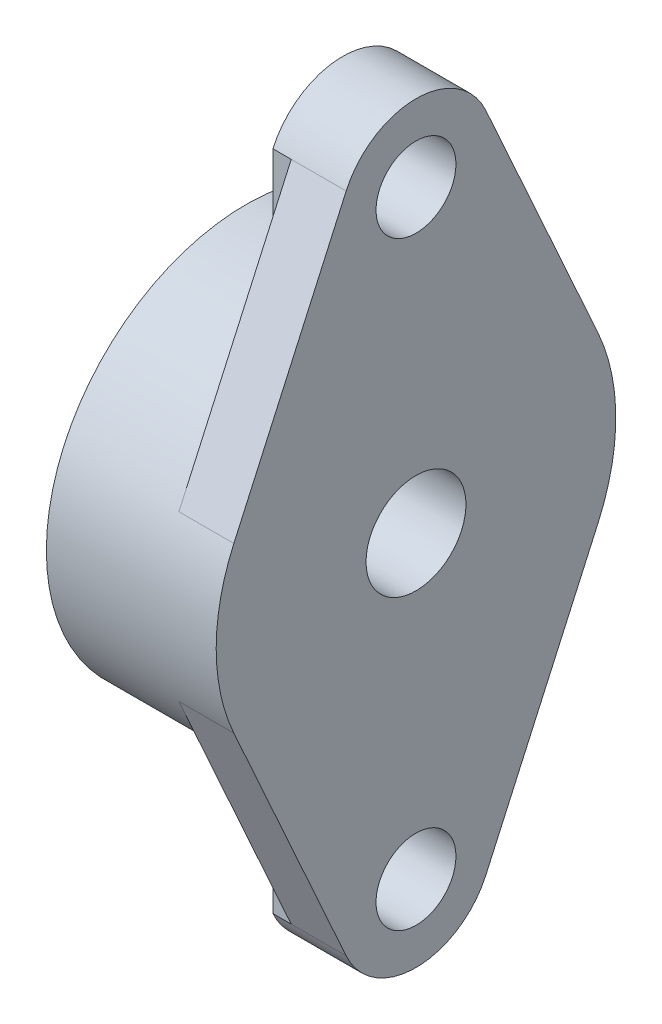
ISO-10303-21;
HEADER;
FILE_DESCRIPTION(('STEP AP214'),'2;1');
FILE_NAME('part.step','',(''),(''),'','','');
FILE_SCHEMA(('AUTOMOTIVE_DESIGN { 1 0 10303 214 1 1 1 1 }'));
ENDSEC;
DATA;
#1=APPLICATION_CONTEXT('core data for automotive mechanical design processes');
#2=APPLICATION_PROTOCOL_DEFINITION('international standard','automotive_design',2000,#1);
#3=PRODUCT_CONTEXT('',#1,'mechanical');
#4=PRODUCT('Part','Part','',(#3));
#5=PRODUCT_RELATED_PRODUCT_CATEGORY('part','',(#4));
#6=PRODUCT_DEFINITION_FORMATION('','',#4);
#7=PRODUCT_DEFINITION_CONTEXT('part definition',#1,'design');
#8=PRODUCT_DEFINITION('design','',#6,#7);
#9=PRODUCT_DEFINITION_SHAPE('','',#8);
#10=(LENGTH_UNIT() NAMED_UNIT(*) SI_UNIT(.MILLI.,.METRE.));
#11=(NAMED_UNIT(*) PLANE_ANGLE_UNIT() SI_UNIT($,.RADIAN.));
#12=(NAMED_UNIT(*) SI_UNIT($,.STERADIAN.) SOLID_ANGLE_UNIT());
#13=UNCERTAINTY_MEASURE_WITH_UNIT(LENGTH_MEASURE(1.E-05),#10,'distance_accuracy_value','');
#14=(GEOMETRIC_REPRESENTATION_CONTEXT(3) GLOBAL_UNCERTAINTY_ASSIGNED_CONTEXT((#13)) GLOBAL_UNIT_ASSIGNED_CONTEXT((#10,
#11,#12)) REPRESENTATION_CONTEXT('',''));
#15=CARTESIAN_POINT('',(0.,0.,0.));
#16=DIRECTION('',(0.,0.,1.));
#17=DIRECTION('',(1.,0.,0.));
#18=AXIS2_PLACEMENT_3D('',#15,#16,#17);
#19=CARTESIAN_POINT('',(-8.25,-49.9521254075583,-27.3475572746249));
#20=DIRECTION('',(-1.,0.,0.));
#21=DIRECTION('',(0.,0.,1.));
#22=AXIS2_PLACEMENT_3D('',#19,#20,#21);
#23=PLANE('',#22);
#24=DIRECTION('',(0.,-1.,0.));
#25=VECTOR('',#24,1.);
#26=CARTESIAN_POINT('',(-8.25,-38.9182643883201,-10.4832302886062));
#27=LINE('',#26,#25);
#28=CARTESIAN_POINT('',(-8.25,-28.1087509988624,-10.4832302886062));
#29=VERTEX_POINT('',#28);
#30=CARTESIAN_POINT('',(-8.25,-49.7277777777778,-10.4832302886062));
#31=VERTEX_POINT('',#30);
#32=EDGE_CURVE('E71',#29,#31,#27,.T.);
#33=ORIENTED_EDGE('',*,*,#32,.F.);
#34=CARTESIAN_POINT('',(-8.25,0.,0.));
#35=DIRECTION('',(-1.,0.,0.));
#36=DIRECTION('',(0.,0.,1.));
#37=AXIS2_PLACEMENT_3D('',#34,#35,#36);
#38=CIRCLE('',#37,30.);
#39=CARTESIAN_POINT('',(-8.25,-12.3365061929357,-27.3461262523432));
#40=VERTEX_POINT('',#39);
#41=EDGE_CURVE('E208',#40,#29,#38,.T.);
#42=ORIENTED_EDGE('',*,*,#41,.F.);
#43=DIRECTION('',(0.,0.911585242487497,-0.411111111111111));
#44=VECTOR('',#43,1.);
#45=CARTESIAN_POINT('',(-8.25,-31.0305555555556,-18.9153937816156));
#46=LINE('',#45,#44);
#47=EDGE_CURVE('E308',#31,#40,#46,.T.);
#48=ORIENTED_EDGE('',*,*,#47,.F.);
#49=EDGE_LOOP('',(#33,#42,#48));
#50=FACE_BOUND('',#49,.T.);
#51=ADVANCED_FACE('F16',(#50),#23,.T.);
#52=CARTESIAN_POINT('',(-11.,-49.7277777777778,-10.4832302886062));
#53=DIRECTION('',(0.,0.,-1.));
#54=DIRECTION('',(0.,1.,0.));
#55=AXIS2_PLACEMENT_3D('',#52,#53,#54);
#56=PLANE('',#55);
#57=DIRECTION('',(0.,-1.,0.));
#58=VECTOR('',#57,1.);
#59=CARTESIAN_POINT('',(-11.,-42.4463317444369,-10.4832302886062));
#60=LINE('',#59,#58);
#61=CARTESIAN_POINT('',(-11.,-28.1087509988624,-10.4832302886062));
#62=VERTEX_POINT('',#61);
#63=CARTESIAN_POINT('',(-11.,-49.7277777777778,-10.4832302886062));
#64=VERTEX_POINT('',#63);
#65=EDGE_CURVE('E65',#62,#64,#60,.T.);
#66=ORIENTED_EDGE('',*,*,#65,.F.);
#67=DIRECTION('',(-1.,0.,0.));
#68=VECTOR('',#67,1.);
#69=CARTESIAN_POINT('',(-12.75,-28.1087509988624,-10.4832302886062));
#70=LINE('',#69,#68);
#71=EDGE_CURVE('E300',#29,#62,#70,.T.);
#72=ORIENTED_EDGE('',*,*,#71,.F.);
#73=ORIENTED_EDGE('',*,*,#32,.T.);
#74=DIRECTION('',(1.,0.,0.));
#75=VECTOR('',#74,1.);
#76=CARTESIAN_POINT('',(-5.5,-49.7277777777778,-10.4832302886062));
#77=LINE('',#76,#75);
#78=EDGE_CURVE('E316',#64,#31,#77,.T.);
#79=ORIENTED_EDGE('',*,*,#78,.F.);
#80=EDGE_LOOP('',(#66,#72,#73,#79));
#81=FACE_BOUND('',#80,.T.);
#82=ADVANCED_FACE('F482',(#81),#56,.T.);
#83=CARTESIAN_POINT('',(-8.25,12.1121584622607,-27.3475572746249));
#84=DIRECTION('',(-1.,0.,0.));
#85=DIRECTION('',(0.,0.,1.));
#86=AXIS2_PLACEMENT_3D('',#83,#84,#85);
#87=PLANE('',#86);
#88=CARTESIAN_POINT('',(-8.25,0.,0.));
#89=DIRECTION('',(-1.,0.,0.));
#90=DIRECTION('',(0.,0.,1.));
#91=AXIS2_PLACEMENT_3D('',#88,#89,#90);
#92=CIRCLE('',#91,30.);
#93=CARTESIAN_POINT('',(-8.25,28.1087509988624,-10.4832302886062));
#94=VERTEX_POINT('',#93);
#95=CARTESIAN_POINT('',(-8.25,12.3365061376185,-27.3461262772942));
#96=VERTEX_POINT('',#95);
#97=EDGE_CURVE('E360',#94,#96,#92,.T.);
#98=ORIENTED_EDGE('',*,*,#97,.F.);
#99=DIRECTION('',(0.,-1.,0.));
#100=VECTOR('',#99,1.);
#101=CARTESIAN_POINT('',(-8.25,38.9182643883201,-10.4832302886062));
#102=LINE('',#101,#100);
#103=CARTESIAN_POINT('',(-8.25,49.7277777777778,-10.4832302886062));
#104=VERTEX_POINT('',#103);
#105=EDGE_CURVE('E270',#104,#94,#102,.T.);
#106=ORIENTED_EDGE('',*,*,#105,.F.);
#107=DIRECTION('',(0.,0.911585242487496,0.411111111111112));
#108=VECTOR('',#107,1.);
#109=CARTESIAN_POINT('',(-8.25,31.0305555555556,-18.9153937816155));
#110=LINE('',#109,#108);
#111=EDGE_CURVE('E203',#96,#104,#110,.T.);
#112=ORIENTED_EDGE('',*,*,#111,.F.);
#113=EDGE_LOOP('',(#98,#106,#112));
#114=FACE_BOUND('',#113,.T.);
#115=ADVANCED_FACE('F371',(#114),#87,.T.);
#116=CARTESIAN_POINT('',(-11.,28.1087509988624,-10.4832302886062));
#117=DIRECTION('',(0.,0.,-1.));
#118=DIRECTION('',(0.,1.,0.));
#119=AXIS2_PLACEMENT_3D('',#116,#117,#118);
#120=PLANE('',#119);
#121=DIRECTION('',(0.,-1.,0.));
#122=VECTOR('',#121,1.);
#123=CARTESIAN_POINT('',(-11.,42.4463317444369,-10.4832302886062));
#124=LINE('',#123,#122);
#125=CARTESIAN_POINT('',(-11.,49.7277777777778,-10.4832302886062));
#126=VERTEX_POINT('',#125);
#127=CARTESIAN_POINT('',(-11.,28.1087509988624,-10.4832302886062));
#128=VERTEX_POINT('',#127);
#129=EDGE_CURVE('E245',#126,#128,#124,.T.);
#130=ORIENTED_EDGE('',*,*,#129,.F.);
#131=DIRECTION('',(-1.,0.,0.));
#132=VECTOR('',#131,1.);
#133=CARTESIAN_POINT('',(-5.5,49.7277777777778,-10.4832302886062));
#134=LINE('',#133,#132);
#135=EDGE_CURVE('E197',#104,#126,#134,.T.);
#136=ORIENTED_EDGE('',*,*,#135,.F.);
#137=ORIENTED_EDGE('',*,*,#105,.T.);
#138=DIRECTION('',(1.,0.,0.));
#139=VECTOR('',#138,1.);
#140=CARTESIAN_POINT('',(-12.75,28.1087509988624,-10.4832302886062));
#141=LINE('',#140,#139);
#142=EDGE_CURVE('E215',#128,#94,#141,.T.);
#143=ORIENTED_EDGE('',*,*,#142,.F.);
#144=EDGE_LOOP('',(#130,#136,#137,#143));
#145=FACE_BOUND('',#144,.T.);
#146=ADVANCED_FACE('F366',(#145),#120,.T.);
#147=CARTESIAN_POINT('',(-11.,-28.1087509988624,10.4832302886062));
#148=DIRECTION('',(0.,0.,1.));
#149=DIRECTION('',(0.,-1.,0.));
#150=AXIS2_PLACEMENT_3D('',#147,#148,#149);
#151=PLANE('',#150);
#152=DIRECTION('',(0.,1.,0.));
#153=VECTOR('',#152,1.);
#154=CARTESIAN_POINT('',(-11.,-42.4463317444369,10.4832302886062));
#155=LINE('',#154,#153);
#156=CARTESIAN_POINT('',(-11.,-49.7277777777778,10.4832302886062));
#157=VERTEX_POINT('',#156);
#158=CARTESIAN_POINT('',(-11.,-28.1087509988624,10.4832302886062));
#159=VERTEX_POINT('',#158);
#160=EDGE_CURVE('E59',#157,#159,#155,.T.);
#161=ORIENTED_EDGE('',*,*,#160,.F.);
#162=DIRECTION('',(-1.,0.,0.));
#163=VECTOR('',#162,1.);
#164=CARTESIAN_POINT('',(-5.5,-49.7277777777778,10.4832302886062));
#165=LINE('',#164,#163);
#166=CARTESIAN_POINT('',(-8.25,-49.7277777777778,10.4832302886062));
#167=VERTEX_POINT('',#166);
#168=EDGE_CURVE('E257',#167,#157,#165,.T.);
#169=ORIENTED_EDGE('',*,*,#168,.F.);
#170=DIRECTION('',(0.,1.,0.));
#171=VECTOR('',#170,1.);
#172=CARTESIAN_POINT('',(-8.25,-49.7277777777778,10.4832302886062));
#173=LINE('',#172,#171);
#174=CARTESIAN_POINT('',(-8.25,-28.1087509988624,10.4832302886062));
#175=VERTEX_POINT('',#174);
#176=EDGE_CURVE('E251',#175,#167,#173,.F.);
#177=ORIENTED_EDGE('',*,*,#176,.F.);
#178=DIRECTION('',(1.,0.,0.));
#179=VECTOR('',#178,1.);
#180=CARTESIAN_POINT('',(-12.75,-28.1087509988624,10.4832302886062));
#181=LINE('',#180,#179);
#182=EDGE_CURVE('E277',#159,#175,#181,.T.);
#183=ORIENTED_EDGE('',*,*,#182,.F.);
#184=EDGE_LOOP('',(#161,#169,#177,#183));
#185=FACE_BOUND('',#184,.T.);
#186=ADVANCED_FACE('F432',(#185),#151,.T.);
#187=CARTESIAN_POINT('',(-8.25,12.1121585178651,10.4832302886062));
#188=DIRECTION('',(-1.,0.,0.));
#189=DIRECTION('',(0.,0.,1.));
#190=AXIS2_PLACEMENT_3D('',#187,#188,#189);
#191=PLANE('',#190);
#192=DIRECTION('',(0.,1.,0.));
#193=VECTOR('',#192,1.);
#194=CARTESIAN_POINT('',(-8.25,38.9182643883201,10.4832302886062));
#195=LINE('',#194,#193);
#196=CARTESIAN_POINT('',(-8.25,28.1087509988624,10.4832302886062));
#197=VERTEX_POINT('',#196);
#198=CARTESIAN_POINT('',(-8.25,49.7277777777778,10.4832302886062));
#199=VERTEX_POINT('',#198);
#200=EDGE_CURVE('E133',#197,#199,#195,.T.);
#201=ORIENTED_EDGE('',*,*,#200,.F.);
#202=CARTESIAN_POINT('',(-8.25,0.,0.));
#203=DIRECTION('',(-1.,0.,0.));
#204=DIRECTION('',(0.,0.,1.));
#205=AXIS2_PLACEMENT_3D('',#202,#203,#204);
#206=CIRCLE('',#205,30.);
#207=CARTESIAN_POINT('',(-8.25,12.3365061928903,27.3461262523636));
#208=VERTEX_POINT('',#207);
#209=EDGE_CURVE('E184',#208,#197,#206,.T.);
#210=ORIENTED_EDGE('',*,*,#209,.F.);
#211=DIRECTION('',(0.,-0.911585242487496,0.411111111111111));
#212=VECTOR('',#211,1.);
#213=CARTESIAN_POINT('',(-8.25,31.0305555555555,18.9153937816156));
#214=LINE('',#213,#212);
#215=EDGE_CURVE('E274',#199,#208,#214,.T.);
#216=ORIENTED_EDGE('',*,*,#215,.F.);
#217=EDGE_LOOP('',(#201,#210,#216));
#218=FACE_BOUND('',#217,.T.);
#219=ADVANCED_FACE('F420',(#218),#191,.T.);
#220=CARTESIAN_POINT('',(-11.,49.7277777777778,10.4832302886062));
#221=DIRECTION('',(0.,0.,1.));
#222=DIRECTION('',(0.,-1.,0.));
#223=AXIS2_PLACEMENT_3D('',#220,#221,#222);
#224=PLANE('',#223);
#225=DIRECTION('',(0.,1.,0.));
#226=VECTOR('',#225,1.);
#227=CARTESIAN_POINT('',(-11.,42.4463317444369,10.4832302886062));
#228=LINE('',#227,#226);
#229=CARTESIAN_POINT('',(-11.,28.1087509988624,10.4832302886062));
#230=VERTEX_POINT('',#229);
#231=CARTESIAN_POINT('',(-11.,49.7277777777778,10.4832302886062));
#232=VERTEX_POINT('',#231);
#233=EDGE_CURVE('E128',#230,#232,#228,.T.);
#234=ORIENTED_EDGE('',*,*,#233,.F.);
#235=DIRECTION('',(-1.,0.,0.));
#236=VECTOR('',#235,1.);
#237=CARTESIAN_POINT('',(-12.75,28.1087509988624,10.4832302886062));
#238=LINE('',#237,#236);
#239=EDGE_CURVE('E267',#197,#230,#238,.T.);
#240=ORIENTED_EDGE('',*,*,#239,.F.);
#241=ORIENTED_EDGE('',*,*,#200,.T.);
#242=DIRECTION('',(1.,0.,0.));
#243=VECTOR('',#242,1.);
#244=CARTESIAN_POINT('',(-5.5,49.7277777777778,10.4832302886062));
#245=LINE('',#244,#243);
#246=EDGE_CURVE('E284',#232,#199,#245,.T.);
#247=ORIENTED_EDGE('',*,*,#246,.F.);
#248=EDGE_LOOP('',(#234,#240,#241,#247));
#249=FACE_BOUND('',#248,.T.);
#250=ADVANCED_FACE('F424',(#249),#224,.T.);
#251=CARTESIAN_POINT('',(-8.25,-49.9521254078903,10.4832302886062));
#252=DIRECTION('',(-1.,0.,0.));
#253=DIRECTION('',(0.,0.,1.));
#254=AXIS2_PLACEMENT_3D('',#251,#252,#253);
#255=PLANE('',#254);
#256=CARTESIAN_POINT('',(-8.25,0.,0.));
#257=DIRECTION('',(-1.,0.,0.));
#258=DIRECTION('',(0.,0.,1.));
#259=AXIS2_PLACEMENT_3D('',#256,#257,#258);
#260=CIRCLE('',#259,30.);
#261=CARTESIAN_POINT('',(-8.25,-12.3365061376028,27.3461262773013));
#262=VERTEX_POINT('',#261);
#263=EDGE_CURVE('E154',#175,#262,#260,.T.);
#264=ORIENTED_EDGE('',*,*,#263,.F.);
#265=ORIENTED_EDGE('',*,*,#176,.T.);
#266=DIRECTION('',(0.,-0.911585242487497,-0.411111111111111));
#267=VECTOR('',#266,1.);
#268=CARTESIAN_POINT('',(-8.25,-31.0305555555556,18.9153937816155));
#269=LINE('',#268,#267);
#270=EDGE_CURVE('E171',#262,#167,#269,.T.);
#271=ORIENTED_EDGE('',*,*,#270,.F.);
#272=EDGE_LOOP('',(#264,#265,#271));
#273=FACE_BOUND('',#272,.T.);
#274=ADVANCED_FACE('F238',(#273),#255,.T.);
#275=CARTESIAN_POINT('',(-11.,28.1087509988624,10.4832302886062));
#276=CARTESIAN_POINT('',(-11.,56.5,10.4832302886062));
#277=CARTESIAN_POINT('',(-11.,56.7839124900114,10.4832302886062));
#278=B_SPLINE_CURVE_WITH_KNOTS('',1,(#275,#276,#277),.UNSPECIFIED.,.F.,.F.,(2,1,2),(0.,1.,1.01),.UNSPECIFIED.);
#279=DIRECTION('',(0.,0.,-1.));
#280=VECTOR('',#279,1.);
#281=SURFACE_OF_LINEAR_EXTRUSION('',#278,#280);
#282=CARTESIAN_POINT('',(-11.,45.,0.));
#283=DIRECTION('',(1.,0.,0.));
#284=DIRECTION('',(0.,0.,-1.));
#285=AXIS2_PLACEMENT_3D('',#282,#283,#284);
#286=CIRCLE('',#285,6.00000000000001);
#287=CARTESIAN_POINT('',(-11.,45.,-6.00000000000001));
#288=VERTEX_POINT('',#287);
#289=EDGE_CURVE('E165',#288,#288,#286,.F.);
#290=ORIENTED_EDGE('',*,*,#289,.F.);
#291=EDGE_LOOP('',(#290));
#292=FACE_BOUND('',#291,.T.);
#293=ORIENTED_EDGE('',*,*,#129,.T.);
#294=CARTESIAN_POINT('',(-11.,0.,0.));
#295=DIRECTION('',(-1.,0.,0.));
#296=DIRECTION('',(0.,0.,1.));
#297=AXIS2_PLACEMENT_3D('',#294,#295,#296);
#298=CIRCLE('',#297,30.);
#299=EDGE_CURVE('E261',#230,#128,#298,.T.);
#300=ORIENTED_EDGE('',*,*,#299,.F.);
#301=ORIENTED_EDGE('',*,*,#233,.T.);
#302=CARTESIAN_POINT('',(-11.,45.,0.));
#303=DIRECTION('',(1.,0.,0.));
#304=DIRECTION('',(0.,0.,-1.));
#305=AXIS2_PLACEMENT_3D('',#302,#303,#304);
#306=CIRCLE('',#305,11.5);
#307=EDGE_CURVE('E288',#126,#232,#306,.T.);
#308=ORIENTED_EDGE('',*,*,#307,.F.);
#309=EDGE_LOOP('',(#293,#300,#301,#308));
#310=FACE_BOUND('',#309,.T.);
#311=ADVANCED_FACE('F232',(#292,#310),#281,.T.);
#312=CARTESIAN_POINT('',(-11.,-56.7839124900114,10.4832302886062));
#313=CARTESIAN_POINT('',(-11.,-56.5,10.4832302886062));
#314=CARTESIAN_POINT('',(-11.,-28.1087509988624,10.4832302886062));
#315=B_SPLINE_CURVE_WITH_KNOTS('',1,(#312,#313,#314),.UNSPECIFIED.,.F.,.F.,(2,1,2),(-0.01,0.,
1.),.UNSPECIFIED.);
#316=DIRECTION('',(0.,0.,-1.));
#317=VECTOR('',#316,1.);
#318=SURFACE_OF_LINEAR_EXTRUSION('',#315,#317);
#319=CARTESIAN_POINT('',(-11.,-45.,0.));
#320=DIRECTION('',(1.,0.,0.));
#321=DIRECTION('',(0.,0.,-1.));
#322=AXIS2_PLACEMENT_3D('',#319,#320,#321);
#323=CIRCLE('',#322,6.);
#324=CARTESIAN_POINT('',(-11.,-45.,-6.));
#325=VERTEX_POINT('',#324);
#326=EDGE_CURVE('E169',#325,#325,#323,.F.);
#327=ORIENTED_EDGE('',*,*,#326,.F.);
#328=EDGE_LOOP('',(#327));
#329=FACE_BOUND('',#328,.T.);
#330=ORIENTED_EDGE('',*,*,#65,.T.);
#331=CARTESIAN_POINT('',(-11.,-45.,0.));
#332=DIRECTION('',(1.,0.,0.));
#333=DIRECTION('',(0.,0.,-1.));
#334=AXIS2_PLACEMENT_3D('',#331,#332,#333);
#335=CIRCLE('',#334,11.5);
#336=EDGE_CURVE('E19',#157,#64,#335,.T.);
#337=ORIENTED_EDGE('',*,*,#336,.F.);
#338=ORIENTED_EDGE('',*,*,#160,.T.);
#339=CARTESIAN_POINT('',(-11.,0.,0.));
#340=DIRECTION('',(-1.,0.,0.));
#341=DIRECTION('',(0.,0.,1.));
#342=AXIS2_PLACEMENT_3D('',#339,#340,#341);
#343=CIRCLE('',#342,30.);
#344=EDGE_CURVE('E353',#62,#159,#343,.T.);
#345=ORIENTED_EDGE('',*,*,#344,.F.);
#346=EDGE_LOOP('',(#330,#337,#338,#345));
#347=FACE_BOUND('',#346,.T.);
#348=ADVANCED_FACE('F227',(#329,#347),#318,.T.);
#349=CARTESIAN_POINT('',(-25.5,-30.,30.3600010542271));
#350=DIRECTION('',(-1.,0.,0.));
#351=DIRECTION('',(0.,1.,0.));
#352=AXIS2_PLACEMENT_3D('',#349,#350,#351);
#353=PLANE('',#352);
#354=CARTESIAN_POINT('',(-25.5,0.,0.));
#355=DIRECTION('',(-1.,0.,0.));
#356=DIRECTION('',(0.,0.,1.));
#357=AXIS2_PLACEMENT_3D('',#354,#355,#356);
#358=CIRCLE('',#357,11.25);
#359=CARTESIAN_POINT('',(-25.5,0.,11.25));
#360=VERTEX_POINT('',#359);
#361=EDGE_CURVE('E344',#360,#360,#358,.T.);
#362=ORIENTED_EDGE('',*,*,#361,.F.);
#363=EDGE_LOOP('',(#362));
#364=FACE_BOUND('',#363,.T.);
#365=CARTESIAN_POINT('',(-25.5,0.,0.));
#366=DIRECTION('',(-1.,0.,0.));
#367=DIRECTION('',(0.,0.,1.));
#368=AXIS2_PLACEMENT_3D('',#365,#366,#367);
#369=CIRCLE('',#368,30.);
#370=CARTESIAN_POINT('',(-25.5,0.,30.));
#371=VERTEX_POINT('',#370);
#372=EDGE_CURVE('E190',#371,#371,#369,.F.);
#373=ORIENTED_EDGE('',*,*,#372,.F.);
#374=EDGE_LOOP('',(#373));
#375=FACE_BOUND('',#374,.T.);
#376=ADVANCED_FACE('F231',(#364,#375),#353,.T.);
#377=CARTESIAN_POINT('',(0.,-45.,0.));
#378=DIRECTION('',(1.,0.,0.));
#379=DIRECTION('',(0.,0.,-1.));
#380=AXIS2_PLACEMENT_3D('',#377,#378,#379);
#381=CYLINDRICAL_SURFACE('',#380,11.5);
#382=ORIENTED_EDGE('',*,*,#336,.T.);
#383=ORIENTED_EDGE('',*,*,#78,.T.);
#384=DIRECTION('',(1.,0.,0.));
#385=VECTOR('',#384,1.);
#386=CARTESIAN_POINT('',(-8.25,-49.7277777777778,-10.4832302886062));
#387=LINE('',#386,#385);
#388=CARTESIAN_POINT('',(0.,-49.7277777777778,-10.4832302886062));
#389=VERTEX_POINT('',#388);
#390=EDGE_CURVE('E212',#389,#31,#387,.F.);
#391=ORIENTED_EDGE('',*,*,#390,.F.);
#392=CARTESIAN_POINT('',(0.,-45.,0.));
#393=DIRECTION('',(1.,0.,0.));
#394=DIRECTION('',(0.,0.,-1.));
#395=AXIS2_PLACEMENT_3D('',#392,#393,#394);
#396=CIRCLE('',#395,11.5);
#397=CARTESIAN_POINT('',(0.,-49.7277777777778,10.4832302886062));
#398=VERTEX_POINT('',#397);
#399=EDGE_CURVE('E341',#398,#389,#396,.T.);
#400=ORIENTED_EDGE('',*,*,#399,.F.);
#401=DIRECTION('',(1.,0.,0.));
#402=VECTOR('',#401,1.);
#403=CARTESIAN_POINT('',(-8.25,-49.7277777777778,10.4832302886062));
#404=LINE('',#403,#402);
#405=EDGE_CURVE('E166',#167,#398,#404,.T.);
#406=ORIENTED_EDGE('',*,*,#405,.F.);
#407=ORIENTED_EDGE('',*,*,#168,.T.);
#408=EDGE_LOOP('',(#382,#383,#391,#400,#406,#407));
#409=FACE_BOUND('',#408,.T.);
#410=ADVANCED_FACE('F454',(#409),#381,.T.);
#411=CARTESIAN_POINT('',(-8.25,-49.7277777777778,-10.4832302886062));
#412=DIRECTION('',(0.,-0.411111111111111,-0.911585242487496));
#413=DIRECTION('',(0.,0.911585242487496,-0.411111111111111));
#414=AXIS2_PLACEMENT_3D('',#411,#412,#413);
#415=PLANE('',#414);
#416=CARTESIAN_POINT('',(0.,-49.7277777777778,-10.4832302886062));
#417=CARTESIAN_POINT('',(0.,-48.1696759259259,-11.1859105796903));
#418=CARTESIAN_POINT('',(0.,-46.6115740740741,-11.8885908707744));
#419=CARTESIAN_POINT('',(0.,-43.4953703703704,-13.2939514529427));
#420=CARTESIAN_POINT('',(0.,-41.9372685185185,-13.9966317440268));
#421=CARTESIAN_POINT('',(0.,-38.8210648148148,-15.401992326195));
#422=CARTESIAN_POINT('',(0.,-37.262962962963,-16.1046726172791));
#423=CARTESIAN_POINT('',(0.,-34.1467592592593,-17.5100331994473));
#424=CARTESIAN_POINT('',(0.,-32.5886574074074,-18.2127134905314));
#425=CARTESIAN_POINT('',(0.,-29.4724537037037,-19.6180740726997));
#426=CARTESIAN_POINT('',(0.,-27.9143518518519,-20.3207543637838));
#427=CARTESIAN_POINT('',(0.,-24.7981481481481,-21.726114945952));
#428=CARTESIAN_POINT('',(0.,-23.2400462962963,-22.4287952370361));
#429=CARTESIAN_POINT('',(0.,-20.1238425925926,-23.8341558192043));
#430=CARTESIAN_POINT('',(0.,-18.5657407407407,-24.5368361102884));
#431=CARTESIAN_POINT('',(0.,-15.4495370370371,-25.9421966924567));
#432=CARTESIAN_POINT('',(0.,-13.8914351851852,-26.6448769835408));
#433=CARTESIAN_POINT('',(0.,-12.3333333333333,-27.3475572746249));
#434=B_SPLINE_CURVE_WITH_KNOTS('',3,(#416,#417,#418,#419,#420,#421,#422,#423,#424,#425,#426,
#427,#428,#429,#430,#431,#432,#433),.UNSPECIFIED.,.F.,.F.,(4,2,2,2,2,2,2,2,4),(0.,
5.12766698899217,10.2553339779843,15.3830009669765,20.5106679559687,25.6383349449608,
30.766001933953,35.8936689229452,41.0213359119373),.UNSPECIFIED.);
#435=CARTESIAN_POINT('',(0.,-12.3333333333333,-27.3475572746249));
#436=VERTEX_POINT('',#435);
#437=EDGE_CURVE('E340',#389,#436,#434,.T.);
#438=ORIENTED_EDGE('',*,*,#437,.F.);
#439=ORIENTED_EDGE('',*,*,#390,.T.);
#440=ORIENTED_EDGE('',*,*,#47,.T.);
#441=CARTESIAN_POINT('',(-8.25,-12.3333333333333,-27.3475572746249));
#442=VERTEX_POINT('',#441);
#443=EDGE_CURVE('E34',#40,#442,#46,.T.);
#444=ORIENTED_EDGE('',*,*,#443,.T.);
#445=DIRECTION('',(-1.,0.,0.));
#446=VECTOR('',#445,1.);
#447=CARTESIAN_POINT('',(-12.75,-12.3333333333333,-27.3475572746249));
#448=LINE('',#447,#446);
#449=EDGE_CURVE('E206',#436,#442,#448,.T.);
#450=ORIENTED_EDGE('',*,*,#449,.F.);
#451=EDGE_LOOP('',(#438,#439,#440,#444,#450));
#452=FACE_BOUND('',#451,.T.);
#453=ADVANCED_FACE('F472',(#452),#415,.T.);
#454=CARTESIAN_POINT('',(-8.25,12.3333333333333,-27.3475572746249));
#455=DIRECTION('',(0.,0.411111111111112,-0.911585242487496));
#456=DIRECTION('',(0.,0.911585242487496,0.411111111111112));
#457=AXIS2_PLACEMENT_3D('',#454,#455,#456);
#458=PLANE('',#457);
#459=CARTESIAN_POINT('',(0.,12.3333333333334,-27.3475572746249));
#460=CARTESIAN_POINT('',(0.,13.8914351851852,-26.6448769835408));
#461=CARTESIAN_POINT('',(0.,15.4495370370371,-25.9421966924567));
#462=CARTESIAN_POINT('',(0.,18.5657407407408,-24.5368361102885));
#463=CARTESIAN_POINT('',(0.,20.1238425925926,-23.8341558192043));
#464=CARTESIAN_POINT('',(0.,23.2400462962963,-22.4287952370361));
#465=CARTESIAN_POINT('',(0.,24.7981481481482,-21.726114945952));
#466=CARTESIAN_POINT('',(0.,27.9143518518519,-20.3207543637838));
#467=CARTESIAN_POINT('',(0.,29.4724537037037,-19.6180740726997));
#468=CARTESIAN_POINT('',(0.,32.5886574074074,-18.2127134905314));
#469=CARTESIAN_POINT('',(0.,34.1467592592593,-17.5100331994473));
#470=CARTESIAN_POINT('',(0.,37.262962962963,-16.1046726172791));
#471=CARTESIAN_POINT('',(0.,38.8210648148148,-15.401992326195));
#472=CARTESIAN_POINT('',(0.,41.9372685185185,-13.9966317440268));
#473=CARTESIAN_POINT('',(0.,43.4953703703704,-13.2939514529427));
#474=CARTESIAN_POINT('',(0.,46.6115740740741,-11.8885908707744));
#475=CARTESIAN_POINT('',(0.,48.1696759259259,-11.1859105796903));
#476=CARTESIAN_POINT('',(0.,49.7277777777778,-10.4832302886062));
#477=B_SPLINE_CURVE_WITH_KNOTS('',3,(#459,#460,#461,#462,#463,#464,#465,#466,#467,#468,#469,
#470,#471,#472,#473,#474,#475,#476),.UNSPECIFIED.,.F.,.F.,(4,2,2,2,2,2,2,2,4),(0.,
5.12766698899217,10.2553339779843,15.3830009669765,20.5106679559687,25.6383349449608,
30.766001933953,35.8936689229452,41.0213359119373),.UNSPECIFIED.);
#478=CARTESIAN_POINT('',(0.,12.3333333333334,-27.3475572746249));
#479=VERTEX_POINT('',#478);
#480=CARTESIAN_POINT('',(0.,49.7277777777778,-10.4832302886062));
#481=VERTEX_POINT('',#480);
#482=EDGE_CURVE('E336',#479,#481,#477,.T.);
#483=ORIENTED_EDGE('',*,*,#482,.F.);
#484=DIRECTION('',(1.,0.,0.));
#485=VECTOR('',#484,1.);
#486=CARTESIAN_POINT('',(-8.25,12.3333333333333,-27.3475572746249));
#487=LINE('',#486,#485);
#488=CARTESIAN_POINT('',(-8.25,12.3333333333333,-27.3475572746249));
#489=VERTEX_POINT('',#488);
#490=EDGE_CURVE('E198',#479,#489,#487,.F.);
#491=ORIENTED_EDGE('',*,*,#490,.T.);
#492=CARTESIAN_POINT('',(-8.25,0.,0.));
#493=DIRECTION('',(-1.,0.,0.));
#494=DIRECTION('',(0.,1.,0.));
#495=AXIS2_PLACEMENT_3D('',#492,#493,#494);
#496=CIRCLE('',#495,30.);
#497=EDGE_CURVE('E209',#96,#489,#496,.T.);
#498=ORIENTED_EDGE('',*,*,#497,.F.);
#499=ORIENTED_EDGE('',*,*,#111,.T.);
#500=DIRECTION('',(-1.,0.,0.));
#501=VECTOR('',#500,1.);
#502=CARTESIAN_POINT('',(-5.5,49.7277777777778,-10.4832302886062));
#503=LINE('',#502,#501);
#504=EDGE_CURVE('E194',#481,#104,#503,.T.);
#505=ORIENTED_EDGE('',*,*,#504,.F.);
#506=EDGE_LOOP('',(#483,#491,#498,#499,#505));
#507=FACE_BOUND('',#506,.T.);
#508=ADVANCED_FACE('F374',(#507),#458,.T.);
#509=CARTESIAN_POINT('',(0.,45.,0.));
#510=DIRECTION('',(1.,0.,0.));
#511=DIRECTION('',(0.,0.,-1.));
#512=AXIS2_PLACEMENT_3D('',#509,#510,#511);
#513=CYLINDRICAL_SURFACE('',#512,11.5);
#514=ORIENTED_EDGE('',*,*,#307,.T.);
#515=ORIENTED_EDGE('',*,*,#246,.T.);
#516=DIRECTION('',(1.,0.,0.));
#517=VECTOR('',#516,1.);
#518=CARTESIAN_POINT('',(-8.25,49.7277777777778,10.4832302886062));
#519=LINE('',#518,#517);
#520=CARTESIAN_POINT('',(0.,49.7277777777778,10.4832302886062));
#521=VERTEX_POINT('',#520);
#522=EDGE_CURVE('E187',#521,#199,#519,.F.);
#523=ORIENTED_EDGE('',*,*,#522,.F.);
#524=CARTESIAN_POINT('',(0.,45.,0.));
#525=DIRECTION('',(1.,0.,0.));
#526=DIRECTION('',(0.,0.,-1.));
#527=AXIS2_PLACEMENT_3D('',#524,#525,#526);
#528=CIRCLE('',#527,11.5);
#529=EDGE_CURVE('E333',#481,#521,#528,.T.);
#530=ORIENTED_EDGE('',*,*,#529,.F.);
#531=ORIENTED_EDGE('',*,*,#504,.T.);
#532=ORIENTED_EDGE('',*,*,#135,.T.);
#533=EDGE_LOOP('',(#514,#515,#523,#530,#531,#532));
#534=FACE_BOUND('',#533,.T.);
#535=ADVANCED_FACE('F423',(#534),#513,.T.);
#536=CARTESIAN_POINT('',(-8.25,49.7277777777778,10.4832302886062));
#537=DIRECTION('',(0.,0.411111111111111,0.911585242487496));
#538=DIRECTION('',(0.,-0.911585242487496,0.411111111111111));
#539=AXIS2_PLACEMENT_3D('',#536,#537,#538);
#540=PLANE('',#539);
#541=CARTESIAN_POINT('',(0.,49.7277777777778,10.4832302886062));
#542=CARTESIAN_POINT('',(0.,48.1696759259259,11.1859105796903));
#543=CARTESIAN_POINT('',(0.,46.6115740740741,11.8885908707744));
#544=CARTESIAN_POINT('',(0.,43.4953703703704,13.2939514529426));
#545=CARTESIAN_POINT('',(0.,41.9372685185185,13.9966317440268));
#546=CARTESIAN_POINT('',(0.,38.8210648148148,15.401992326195));
#547=CARTESIAN_POINT('',(0.,37.262962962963,16.1046726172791));
#548=CARTESIAN_POINT('',(0.,34.1467592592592,17.5100331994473));
#549=CARTESIAN_POINT('',(0.,32.5886574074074,18.2127134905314));
#550=CARTESIAN_POINT('',(0.,29.4724537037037,19.6180740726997));
#551=CARTESIAN_POINT('',(0.,27.9143518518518,20.3207543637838));
#552=CARTESIAN_POINT('',(0.,24.7981481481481,21.726114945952));
#553=CARTESIAN_POINT('',(0.,23.2400462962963,22.4287952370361));
#554=CARTESIAN_POINT('',(0.,20.1238425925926,23.8341558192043));
#555=CARTESIAN_POINT('',(0.,18.5657407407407,24.5368361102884));
#556=CARTESIAN_POINT('',(0.,15.449537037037,25.9421966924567));
#557=CARTESIAN_POINT('',(0.,13.8914351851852,26.6448769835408));
#558=CARTESIAN_POINT('',(0.,12.3333333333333,27.3475572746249));
#559=B_SPLINE_CURVE_WITH_KNOTS('',3,(#541,#542,#543,#544,#545,#546,#547,#548,#549,#550,#551,
#552,#553,#554,#555,#556,#557,#558),.UNSPECIFIED.,.F.,.F.,(4,2,2,2,2,2,2,2,4),(0.,
5.12766698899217,10.2553339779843,15.3830009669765,20.5106679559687,25.6383349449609,
30.766001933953,35.8936689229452,41.0213359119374),.UNSPECIFIED.);
#560=CARTESIAN_POINT('',(0.,12.3333333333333,27.3475572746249));
#561=VERTEX_POINT('',#560);
#562=EDGE_CURVE('E332',#521,#561,#559,.T.);
#563=ORIENTED_EDGE('',*,*,#562,.F.);
#564=ORIENTED_EDGE('',*,*,#522,.T.);
#565=ORIENTED_EDGE('',*,*,#215,.T.);
#566=CARTESIAN_POINT('',(-8.25,12.3333333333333,27.3475572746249));
#567=VERTEX_POINT('',#566);
#568=EDGE_CURVE('E191',#208,#567,#214,.T.);
#569=ORIENTED_EDGE('',*,*,#568,.T.);
#570=DIRECTION('',(-1.,0.,0.));
#571=VECTOR('',#570,1.);
#572=CARTESIAN_POINT('',(-12.75,12.3333333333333,27.3475572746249));
#573=LINE('',#572,#571);
#574=EDGE_CURVE('E158',#561,#567,#573,.T.);
#575=ORIENTED_EDGE('',*,*,#574,.F.);
#576=EDGE_LOOP('',(#563,#564,#565,#569,#575));
#577=FACE_BOUND('',#576,.T.);
#578=ADVANCED_FACE('F417',(#577),#540,.T.);
#579=CARTESIAN_POINT('',(-25.5,0.,0.));
#580=DIRECTION('',(-1.,0.,0.));
#581=DIRECTION('',(0.,0.,1.));
#582=AXIS2_PLACEMENT_3D('',#579,#580,#581);
#583=CYLINDRICAL_SURFACE('',#582,30.);
#584=ORIENTED_EDGE('',*,*,#372,.T.);
#585=EDGE_LOOP('',(#584));
#586=FACE_BOUND('',#585,.T.);
#587=ORIENTED_EDGE('',*,*,#239,.T.);
#588=ORIENTED_EDGE('',*,*,#299,.T.);
#589=ORIENTED_EDGE('',*,*,#142,.T.);
#590=ORIENTED_EDGE('',*,*,#97,.T.);
#591=ORIENTED_EDGE('',*,*,#497,.T.);
#592=ORIENTED_EDGE('',*,*,#490,.F.);
#593=CARTESIAN_POINT('',(0.,0.,0.));
#594=DIRECTION('',(-1.,0.,0.));
#595=DIRECTION('',(0.,0.,1.));
#596=AXIS2_PLACEMENT_3D('',#593,#594,#595);
#597=CIRCLE('',#596,30.);
#598=EDGE_CURVE('E337',#436,#479,#597,.F.);
#599=ORIENTED_EDGE('',*,*,#598,.F.);
#600=ORIENTED_EDGE('',*,*,#449,.T.);
#601=ORIENTED_EDGE('',*,*,#443,.F.);
#602=ORIENTED_EDGE('',*,*,#41,.T.);
#603=ORIENTED_EDGE('',*,*,#71,.T.);
#604=ORIENTED_EDGE('',*,*,#344,.T.);
#605=ORIENTED_EDGE('',*,*,#182,.T.);
#606=ORIENTED_EDGE('',*,*,#263,.T.);
#607=CARTESIAN_POINT('',(-8.25,0.,0.));
#608=DIRECTION('',(-1.,0.,0.));
#609=DIRECTION('',(0.,1.,0.));
#610=AXIS2_PLACEMENT_3D('',#607,#608,#609);
#611=CIRCLE('',#610,30.);
#612=CARTESIAN_POINT('',(-8.25,-12.3333333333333,27.3475572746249));
#613=VERTEX_POINT('',#612);
#614=EDGE_CURVE('E145',#262,#613,#611,.T.);
#615=ORIENTED_EDGE('',*,*,#614,.T.);
#616=DIRECTION('',(1.,0.,0.));
#617=VECTOR('',#616,1.);
#618=CARTESIAN_POINT('',(-8.25,-12.3333333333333,27.3475572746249));
#619=LINE('',#618,#617);
#620=CARTESIAN_POINT('',(0.,-12.3333333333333,27.3475572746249));
#621=VERTEX_POINT('',#620);
#622=EDGE_CURVE('E150',#621,#613,#619,.F.);
#623=ORIENTED_EDGE('',*,*,#622,.F.);
#624=CARTESIAN_POINT('',(0.,0.,0.));
#625=DIRECTION('',(-1.,0.,0.));
#626=DIRECTION('',(0.,0.,1.));
#627=AXIS2_PLACEMENT_3D('',#624,#625,#626);
#628=CIRCLE('',#627,30.);
#629=EDGE_CURVE('E330',#561,#621,#628,.F.);
#630=ORIENTED_EDGE('',*,*,#629,.F.);
#631=ORIENTED_EDGE('',*,*,#574,.T.);
#632=ORIENTED_EDGE('',*,*,#568,.F.);
#633=ORIENTED_EDGE('',*,*,#209,.T.);
#634=EDGE_LOOP('',(#587,#588,#589,#590,#591,#592,#599,#600,#601,#602,#603,#604,#605,#606,#615,
#623,#630,#631,#632,#633));
#635=FACE_BOUND('',#634,.T.);
#636=ADVANCED_FACE('F148',(#586,#635),#583,.T.);
#637=CARTESIAN_POINT('',(-8.25,-12.3333333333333,27.3475572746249));
#638=DIRECTION('',(0.,-0.411111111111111,0.911585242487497));
#639=DIRECTION('',(0.,-0.911585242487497,-0.411111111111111));
#640=AXIS2_PLACEMENT_3D('',#637,#638,#639);
#641=PLANE('',#640);
#642=CARTESIAN_POINT('',(0.,-12.3333333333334,27.3475572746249));
#643=CARTESIAN_POINT('',(0.,-13.8914351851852,26.6448769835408));
#644=CARTESIAN_POINT('',(0.,-15.4495370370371,25.9421966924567));
#645=CARTESIAN_POINT('',(0.,-18.5657407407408,24.5368361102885));
#646=CARTESIAN_POINT('',(0.,-20.1238425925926,23.8341558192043));
#647=CARTESIAN_POINT('',(0.,-23.2400462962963,22.4287952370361));
#648=CARTESIAN_POINT('',(0.,-24.7981481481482,21.726114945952));
#649=CARTESIAN_POINT('',(0.,-27.9143518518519,20.3207543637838));
#650=CARTESIAN_POINT('',(0.,-29.4724537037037,19.6180740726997));
#651=CARTESIAN_POINT('',(0.,-32.5886574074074,18.2127134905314));
#652=CARTESIAN_POINT('',(0.,-34.1467592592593,17.5100331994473));
#653=CARTESIAN_POINT('',(0.,-37.262962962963,16.1046726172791));
#654=CARTESIAN_POINT('',(0.,-38.8210648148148,15.401992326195));
#655=CARTESIAN_POINT('',(0.,-41.9372685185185,13.9966317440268));
#656=CARTESIAN_POINT('',(0.,-43.4953703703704,13.2939514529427));
#657=CARTESIAN_POINT('',(0.,-46.6115740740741,11.8885908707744));
#658=CARTESIAN_POINT('',(0.,-48.1696759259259,11.1859105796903));
#659=CARTESIAN_POINT('',(0.,-49.7277777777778,10.4832302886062));
#660=B_SPLINE_CURVE_WITH_KNOTS('',3,(#642,#643,#644,#645,#646,#647,#648,#649,#650,#651,#652,
#653,#654,#655,#656,#657,#658,#659),.UNSPECIFIED.,.F.,.F.,(4,2,2,2,2,2,2,2,4),(0.,
5.12766698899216,10.2553339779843,15.3830009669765,20.5106679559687,25.6383349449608,
30.766001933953,35.8936689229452,41.0213359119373),.UNSPECIFIED.);
#661=EDGE_CURVE('E163',#621,#398,#660,.T.);
#662=ORIENTED_EDGE('',*,*,#661,.F.);
#663=ORIENTED_EDGE('',*,*,#622,.T.);
#664=ORIENTED_EDGE('',*,*,#614,.F.);
#665=ORIENTED_EDGE('',*,*,#270,.T.);
#666=ORIENTED_EDGE('',*,*,#405,.T.);
#667=EDGE_LOOP('',(#662,#663,#664,#665,#666));
#668=FACE_BOUND('',#667,.T.);
#669=ADVANCED_FACE('F160',(#668),#641,.T.);
#670=CARTESIAN_POINT('',(-11.,45.,0.));
#671=DIRECTION('',(1.,0.,0.));
#672=DIRECTION('',(0.,0.,-1.));
#673=AXIS2_PLACEMENT_3D('',#670,#671,#672);
#674=CYLINDRICAL_SURFACE('',#673,6.00000000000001);
#675=CARTESIAN_POINT('',(0.,45.,0.));
#676=DIRECTION('',(1.,0.,0.));
#677=DIRECTION('',(0.,0.,-1.));
#678=AXIS2_PLACEMENT_3D('',#675,#676,#677);
#679=CIRCLE('',#678,6.00000000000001);
#680=CARTESIAN_POINT('',(0.,45.,-6.00000000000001));
#681=VERTEX_POINT('',#680);
#682=EDGE_CURVE('E327',#681,#681,#679,.F.);
#683=ORIENTED_EDGE('',*,*,#682,.F.);
#684=EDGE_LOOP('',(#683));
#685=FACE_BOUND('',#684,.T.);
#686=ORIENTED_EDGE('',*,*,#289,.T.);
#687=EDGE_LOOP('',(#686));
#688=FACE_BOUND('',#687,.T.);
#689=ADVANCED_FACE('F463',(#685,#688),#674,.F.);
#690=CARTESIAN_POINT('',(-11.,-45.,0.));
#691=DIRECTION('',(1.,0.,0.));
#692=DIRECTION('',(0.,0.,-1.));
#693=AXIS2_PLACEMENT_3D('',#690,#691,#692);
#694=CYLINDRICAL_SURFACE('',#693,6.);
#695=CARTESIAN_POINT('',(0.,-45.,0.));
#696=DIRECTION('',(1.,0.,0.));
#697=DIRECTION('',(0.,0.,-1.));
#698=AXIS2_PLACEMENT_3D('',#695,#696,#697);
#699=CIRCLE('',#698,6.);
#700=CARTESIAN_POINT('',(0.,-45.,-6.));
#701=VERTEX_POINT('',#700);
#702=EDGE_CURVE('E324',#701,#701,#699,.F.);
#703=ORIENTED_EDGE('',*,*,#702,.F.);
#704=EDGE_LOOP('',(#703));
#705=FACE_BOUND('',#704,.T.);
#706=ORIENTED_EDGE('',*,*,#326,.T.);
#707=EDGE_LOOP('',(#706));
#708=FACE_BOUND('',#707,.T.);
#709=ADVANCED_FACE('F449',(#705,#708),#694,.F.);
#710=CARTESIAN_POINT('',(-33.3,0.,0.));
#711=DIRECTION('',(-1.,0.,0.));
#712=DIRECTION('',(0.,0.,1.));
#713=AXIS2_PLACEMENT_3D('',#710,#711,#712);
#714=CYLINDRICAL_SURFACE('',#713,11.25);
#715=CARTESIAN_POINT('',(-33.3,0.,0.));
#716=DIRECTION('',(-1.,0.,0.));
#717=DIRECTION('',(0.,0.,1.));
#718=AXIS2_PLACEMENT_3D('',#715,#716,#717);
#719=CIRCLE('',#718,11.25);
#720=CARTESIAN_POINT('',(-33.3,0.,11.25));
#721=VERTEX_POINT('',#720);
#722=EDGE_CURVE('E321',#721,#721,#719,.T.);
#723=ORIENTED_EDGE('',*,*,#722,.F.);
#724=EDGE_LOOP('',(#723));
#725=FACE_BOUND('',#724,.T.);
#726=ORIENTED_EDGE('',*,*,#361,.T.);
#727=EDGE_LOOP('',(#726));
#728=FACE_BOUND('',#727,.T.);
#729=ADVANCED_FACE('F401',(#725,#728),#714,.T.);
#730=CARTESIAN_POINT('',(0.,57.6413,30.));
#731=CARTESIAN_POINT('',(0.,56.5,30.));
#732=CARTESIAN_POINT('',(0.,-56.5,30.));
#733=CARTESIAN_POINT('',(0.,-57.63,30.));
#734=B_SPLINE_CURVE_WITH_KNOTS('',1,(#730,#731,#732,#733),.UNSPECIFIED.,.F.,.F.,(2,1,1,2),
(-0.0101,0.,1.,1.01),.UNSPECIFIED.);
#735=DIRECTION('',(0.,0.,-1.));
#736=VECTOR('',#735,1.);
#737=SURFACE_OF_LINEAR_EXTRUSION('',#734,#736);
#738=CARTESIAN_POINT('',(0.,0.,0.));
#739=DIRECTION('',(-1.,0.,0.));
#740=DIRECTION('',(0.,0.,1.));
#741=AXIS2_PLACEMENT_3D('',#738,#739,#740);
#742=CIRCLE('',#741,7.5);
#743=CARTESIAN_POINT('',(0.,0.,7.5));
#744=VERTEX_POINT('',#743);
#745=EDGE_CURVE('E25',#744,#744,#742,.F.);
#746=ORIENTED_EDGE('',*,*,#745,.F.);
#747=EDGE_LOOP('',(#746));
#748=FACE_BOUND('',#747,.T.);
#749=ORIENTED_EDGE('',*,*,#702,.T.);
#750=EDGE_LOOP('',(#749));
#751=FACE_BOUND('',#750,.T.);
#752=ORIENTED_EDGE('',*,*,#682,.T.);
#753=EDGE_LOOP('',(#752));
#754=FACE_BOUND('',#753,.T.);
#755=ORIENTED_EDGE('',*,*,#629,.T.);
#756=ORIENTED_EDGE('',*,*,#661,.T.);
#757=ORIENTED_EDGE('',*,*,#399,.T.);
#758=ORIENTED_EDGE('',*,*,#437,.T.);
#759=ORIENTED_EDGE('',*,*,#598,.T.);
#760=ORIENTED_EDGE('',*,*,#482,.T.);
#761=ORIENTED_EDGE('',*,*,#529,.T.);
#762=ORIENTED_EDGE('',*,*,#562,.T.);
#763=EDGE_LOOP('',(#755,#756,#757,#758,#759,#760,#761,#762));
#764=FACE_BOUND('',#763,.T.);
#765=ADVANCED_FACE('F381',(#748,#751,#754,#764),#737,.T.);
#766=CARTESIAN_POINT('',(-33.3,-11.25,11.3850021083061));
#767=DIRECTION('',(-1.,0.,0.));
#768=DIRECTION('',(0.,1.,0.));
#769=AXIS2_PLACEMENT_3D('',#766,#767,#768);
#770=PLANE('',#769);
#771=CARTESIAN_POINT('',(-33.3,0.,0.));
#772=DIRECTION('',(-1.,0.,0.));
#773=DIRECTION('',(0.,0.,1.));
#774=AXIS2_PLACEMENT_3D('',#771,#772,#773);
#775=CIRCLE('',#774,7.5);
#776=CARTESIAN_POINT('',(-33.3,0.,7.5));
#777=VERTEX_POINT('',#776);
#778=EDGE_CURVE('E10',#777,#777,#775,.T.);
#779=ORIENTED_EDGE('',*,*,#778,.F.);
#780=EDGE_LOOP('',(#779));
#781=FACE_BOUND('',#780,.T.);
#782=ORIENTED_EDGE('',*,*,#722,.T.);
#783=EDGE_LOOP('',(#782));
#784=FACE_BOUND('',#783,.T.);
#785=ADVANCED_FACE('F400',(#781,#784),#770,.T.);
#786=CARTESIAN_POINT('',(0.,0.,0.));
#787=DIRECTION('',(-1.,0.,0.));
#788=DIRECTION('',(0.,0.,1.));
#789=AXIS2_PLACEMENT_3D('',#786,#787,#788);
#790=CYLINDRICAL_SURFACE('',#789,7.5);
#791=ORIENTED_EDGE('',*,*,#745,.T.);
#792=EDGE_LOOP('',(#791));
#793=FACE_BOUND('',#792,.T.);
#794=ORIENTED_EDGE('',*,*,#778,.T.);
#795=EDGE_LOOP('',(#794));
#796=FACE_BOUND('',#795,.T.);
#797=ADVANCED_FACE('F434',(#793,#796),#790,.F.);
#798=CLOSED_SHELL('',(#51,#82,#115,#146,#186,#219,#250,#274,#311,#348,#376,#410,#453,#508,#535,
#578,#636,#669,#689,#709,#729,#765,#785,#797));
#799=MANIFOLD_SOLID_BREP('B1',#798);
#800=ADVANCED_BREP_SHAPE_REPRESENTATION('',(#18,#799),#14);
#801=SHAPE_DEFINITION_REPRESENTATION(#9,#800);
ENDSEC;
END-ISO-10303-21;
